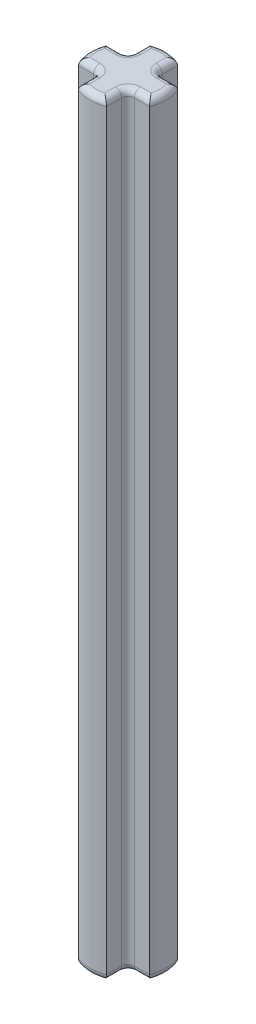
from build123d import *

# Parameters (mm, degrees)
BOSS_EXTRUDE1_DEPTH = 48
FILLET7_R           = 0.4


with BuildPart() as part:
    # Sketch1 → Boss-Extrude1 (new body)
    with BuildSketch(Plane(origin=(0, 0, 0), x_dir=(1, 0, 0), z_dir=(0, 1, 0))):
        with BuildLine():
            Line((-2.232845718, 0.88), (-0.88, 0.88))
            Line((-0.88, 0.88), (-0.88, 2.232845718))
            ThreePointArc((-0.88, 2.232845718), (0, 2.4), (0.88, 2.232845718))
            Line((0.88, 2.232845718), (0.88, 0.88))
            Line((0.88, 0.88), (2.232845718, 0.88))
            ThreePointArc((2.232845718, 0.88), (2.4, 0), (2.232845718, -0.88))
            Line((2.232845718, -0.88), (0.88, -0.88))
            Line((0.88, -0.88), (0.88, -2.232845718))
            ThreePointArc((0.88, -2.232845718), (0, -2.4), (-0.88, -2.232845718))
            Line((-0.88, -2.232845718), (-0.88, -0.88))
            Line((-0.88, -0.88), (-2.232845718, -0.88))
            ThreePointArc((-2.232845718, -0.88), (-2.4, 0), (-2.232845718, 0.88))
        make_face()
    extrude(amount=BOSS_EXTRUDE1_DEPTH)

    # Fillet7
    fillet7_edges = [part.edges().sort_by_distance(p)[0] for p in [
        (-2.4, 48, 0),
        (0, 0, -2.4),
        (0.88, 0, -1.556422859),
        (1.556422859, 0, -0.88),
        (2.4, 0, 0),
        (1.556422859, 0, 0.88),
        (0.88, 0, 1.556422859),
        (-1.556422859, 48, 0.88),
        (0, 0, 2.4),
        (-0.88, 0, 1.556422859),
        (-1.556422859, 0, 0.88),
        (-2.4, 0, 0),
        (-1.556422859, 0, -0.88),
        (-0.88, 0, -1.556422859),
        (-0.88, 48, 1.556422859),
        (0, 48, 2.4),
        (0.88, 24, -0.88),
        (0.88, 24, 0.88),
        (-0.88, 24, 0.88),
        (-0.88, 24, -0.88),
        (0.88, 48, 1.556422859),
        (1.556422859, 48, 0.88),
        (2.4, 48, 0),
        (1.556422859, 48, -0.88),
        (0.88, 48, -1.556422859),
        (0, 48, -2.4),
        (-0.88, 48, -1.556422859),
        (-1.556422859, 48, -0.88),
    ]]
    fillet(fillet7_edges, radius=FILLET7_R)


solid = part.part
